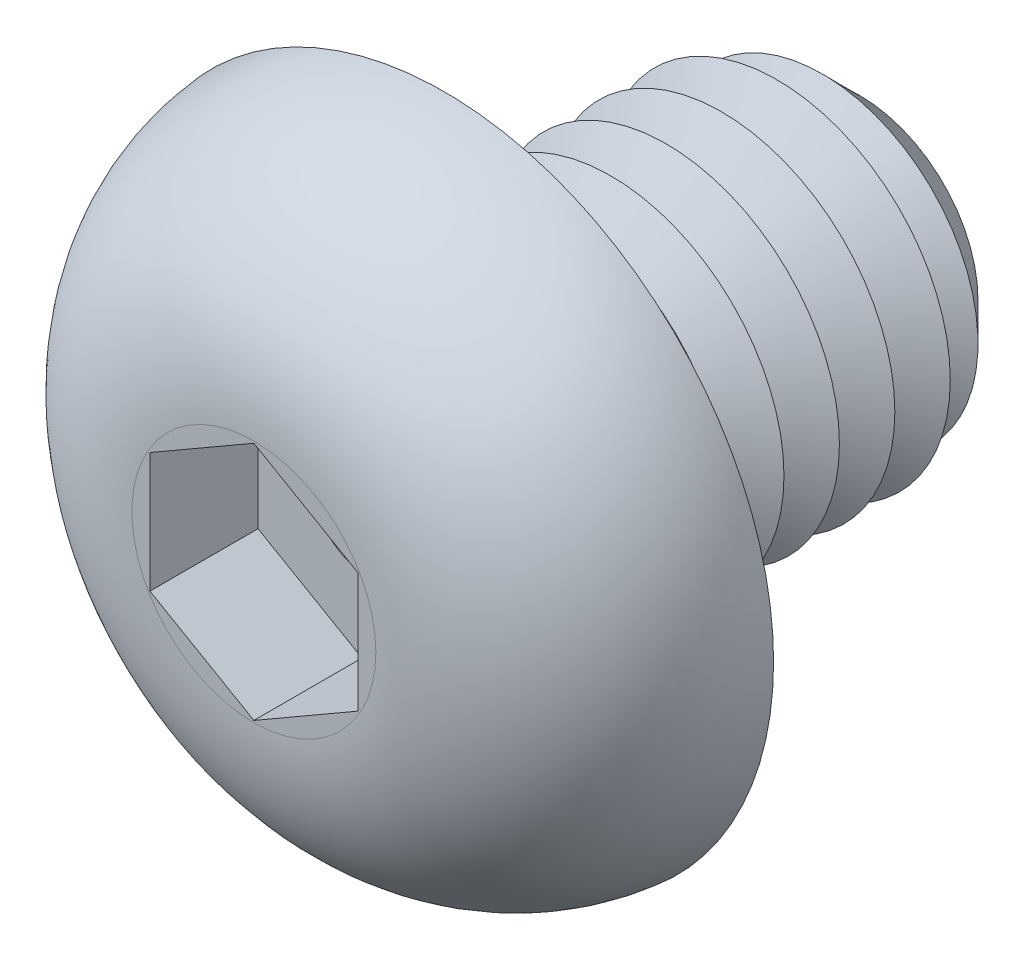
from build123d import *

# Parameters (mm, degrees)
CUT_EXTRUDE1_DEPTH  = 1.56
SKETCH4_R           = 2.5
BOSS_EXTRUDE1_DEPTH = 6
CHAMFER1_SIZE       = 0.8
LPATTERN1_COUNT     = 6
LPATTERN1_PITCH     = 0.8
FILLET2_R           = 0.4
SKETCH6_R           = 0.65
CUT_EXTRUDE2_DEPTH  = 7.19


with BuildPart() as part:
    # Sketch2 → Revolve1 (revolve)
    with BuildSketch(Plane(origin=(0, 0, 0), x_dir=(0, 0, -1), z_dir=(1, 0, 0)), mode=Mode.PRIVATE) as revolve1_sk:
        with BuildLine():
            Line((0, 0), (-2.75, 0))
            Line((-2.75, 0), (-2.75, 1.760434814))
            ThreePointArc((-2.75, 1.760434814), (-1.957940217, 3.791444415), (0, 4.75))
            Line((0, 4.75), (0, 0))
        make_face()
    revolve(revolve1_sk.sketch.rotate(Axis((0, 0, 47.934239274), (0, 0, -1)), 90), axis=Axis((0, 0, 47.934239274), (0, 0, -1)))

    # Sketch3 → Cut-Extrude1 (cut)
    with BuildSketch(Plane.XY.offset(2.75)):
        Polygon((0, 1.732050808), (-1.5, 0.866025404), (-1.5, -0.866025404), (0, -1.732050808), (1.5, -0.866025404), (1.5, 0.866025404), align=None)
    extrude(amount=-CUT_EXTRUDE1_DEPTH, mode=Mode.SUBTRACT)

    # Sketch4 → Boss-Extrude1 (add)
    with BuildSketch(Plane(origin=(0, 0, 0), x_dir=(-1, 0, 0), z_dir=(0, 0, -1))):
        with Locations(Location((0, 0, 0), (0, 0, 180))):
            Circle(SKETCH4_R)
    extrude(amount=BOSS_EXTRUDE1_DEPTH)

    # Chamfer1
    chamfer1_edges = [part.edges().sort_by_distance(p)[0] for p in [
        (-2.5, 0, -6),
    ]]
    chamfer(chamfer1_edges, length=CHAMFER1_SIZE)

    # Sketch5 → Cut-Revolve1 (revolve, cut)
    with BuildSketch(Plane(origin=(0, 0, 0), x_dir=(0, 0, -1), z_dir=(1, 0, 0)), mode=Mode.PRIVATE) as cut_revolve1_sk:
        Polygon((0.8, 2.5), (1.6, 2.5), (1.2, 1.807179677), align=None)
    cut_revolve1 = revolve(cut_revolve1_sk.sketch.rotate(Axis((0, 0, 47.934239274), (0, 0, -1)), 90), axis=Axis((0, 0, 47.934239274), (0, 0, -1)), mode=Mode.SUBTRACT)

    # LPattern1: Cut-Revolve1 ×6
    with Locations(*[(0, 0, -i * LPATTERN1_PITCH) for i in range(1, LPATTERN1_COUNT)]):
        add(cut_revolve1, mode=Mode.SUBTRACT)

    # Fillet2
    fillet2_edges = [part.edges().sort_by_distance(p)[0] for p in [
        (-2.5, 0, 0),
    ]]
    fillet(fillet2_edges, radius=FILLET2_R)

    # Sketch6 → Cut-Extrude2 (cut)
    with BuildSketch(Plane.XY.offset(1.19)):
        Circle(SKETCH6_R)
    extrude(amount=-CUT_EXTRUDE2_DEPTH, mode=Mode.SUBTRACT)


solid = part.part
